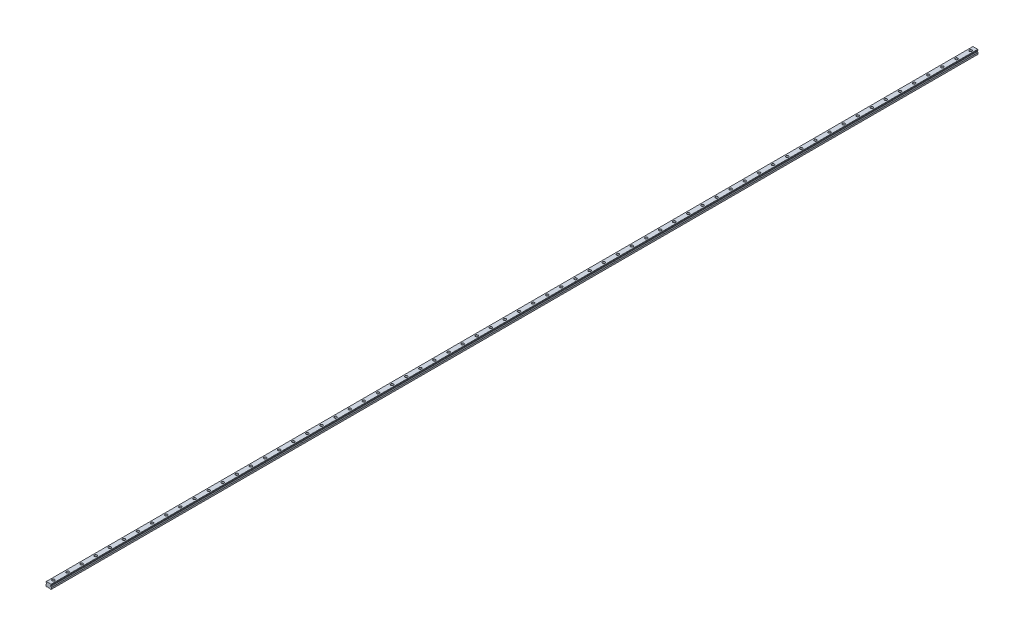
from build123d import *

# Parameters (mm, degrees)
SKETCH1_W           = 23
SKETCH1_H           = 19.2
BOSS_EXTRUDE1_DEPTH = 1970
CUT_EXTRUDE1_DEPTH  = 3941.063564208
CHAMFER1_SIZE       = 1.25
FILLET1_R           = 1.25
CUT_EXTRUDE2_DEPTH  = 3941.063564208
SKETCH4_R           = 5.5
SKETCH4_R_2         = 3.5
CUT_EXTRUDE3_DEPTH  = 9
SKETCH4_2_R         = 3.5
CUT_EXTRUDE4_DEPTH  = 1971.12712534
LPATTERN1_COUNT     = 66
LPATTERN1_PITCH     = 60


with BuildPart() as part:
    # Sketch1 → Boss-Extrude1 (new, symmetric)
    with BuildSketch(Plane.XY):
        with Locations((0, 9.6)):
            Rectangle(SKETCH1_W, SKETCH1_H)
    extrude(amount=BOSS_EXTRUDE1_DEPTH, both=True)

    # Sketch2 → Cut-Extrude1 (cut, through all)
    with BuildSketch(Plane.XY.offset(1970)):
        Polygon((-11.5, 16.7), (-11.5, 7.95), (-8.583333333, 10.866666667), (-8.583333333, 13.783333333), align=None)
        Polygon((8.583333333, 13.783333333), (11.5, 16.7), (11.5, 7.95), (8.583333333, 10.866666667), align=None)
    extrude(amount=-CUT_EXTRUDE1_DEPTH, mode=Mode.SUBTRACT)

    # Chamfer1
    chamfer1_edges = [part.edges().sort_by_distance(p)[0] for p in [
        (-11.5, 19.2, 0),
        (11.5, 19.2, 0),
        (11.5, 0, 0),
        (-11.5, 0, 0),
    ]]
    chamfer(chamfer1_edges, length=CHAMFER1_SIZE)

    # Fillet1
    fillet1_edges = [part.edges().sort_by_distance(p)[0] for p in [
        (-8.583333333, 13.783333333, 0),
        (-8.583333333, 10.866666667, 0),
        (8.583333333, 10.866666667, 0),
        (8.583333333, 13.783333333, 0),
    ]]
    fillet(fillet1_edges, radius=FILLET1_R)

    # Sketch3 → Cut-Extrude2 (cut, through all)
    with BuildSketch(Plane.XY.offset(1970)):
        Polygon((-7, 0), (-5.75, 1.25), (5.75, 1.25), (7, 0), align=None)
    extrude(amount=-CUT_EXTRUDE2_DEPTH, mode=Mode.SUBTRACT)

    # Sketch4 → Cut-Extrude3 (cut)
    with BuildSketch(Plane(origin=(0, 19.2, 0), x_dir=(1, 0, 0), z_dir=(0, 1, 0))):
        with Locations(Location((0, -1950, 0), (0, 0, 270))):
            Circle(SKETCH4_R)
        with Locations(Location((0, -1950, 0), (0, 0, 270))):
            Circle(SKETCH4_R_2, mode=Mode.SUBTRACT)
    cut_extrude3 = extrude(amount=-CUT_EXTRUDE3_DEPTH, mode=Mode.SUBTRACT)

    # Sketch4_2 → Cut-Extrude4 (cut, through all)
    with BuildSketch(Plane(origin=(0, 19.2, 0), x_dir=(1, 0, 0), z_dir=(0, 1, 0))):
        with Locations(Location((0, -1950, 0), (0, 0, 270))):
            Circle(SKETCH4_2_R)
    cut_extrude4 = extrude(amount=-CUT_EXTRUDE4_DEPTH, mode=Mode.SUBTRACT)

    # LPattern1: Cut-Extrude3, Cut-Extrude4 ×66
    with Locations(*[(0, 0, -i * LPATTERN1_PITCH) for i in range(1, LPATTERN1_COUNT)]):
        add(cut_extrude3, mode=Mode.SUBTRACT)
        add(cut_extrude4, mode=Mode.SUBTRACT)


solid = part.part
